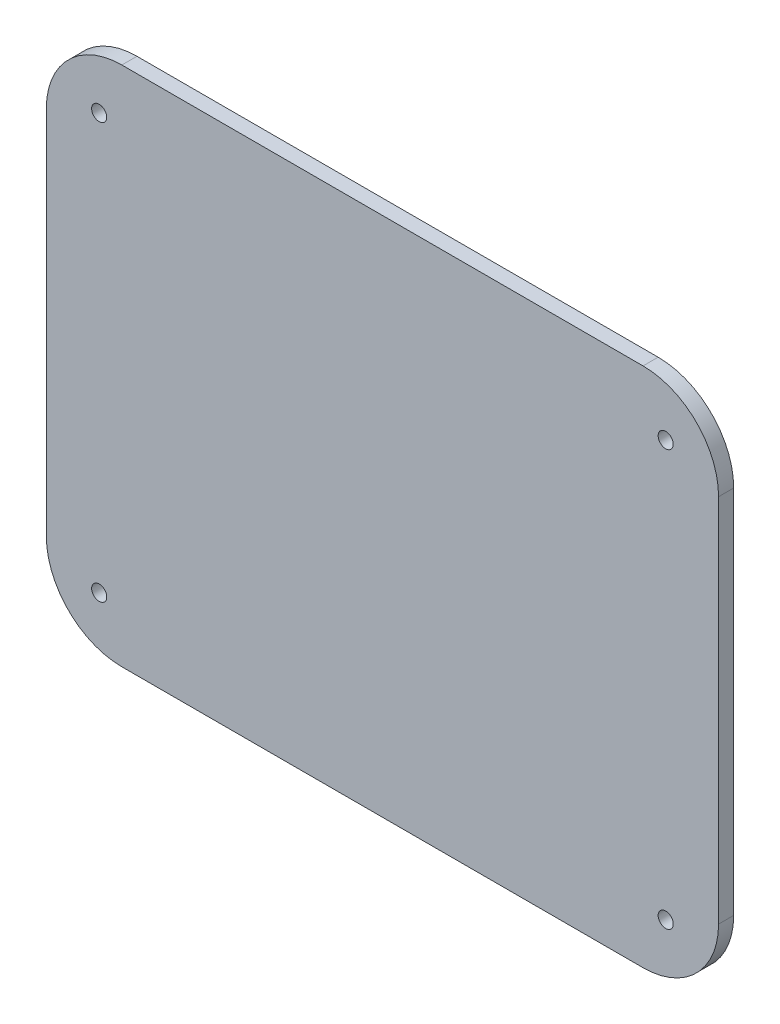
from build123d import *

# Parameters (mm, degrees)
SKETCH_1_R      = 1
EXTRUDE_1_DEPTH = 2


with BuildPart() as part:
    # Sketch 1 → Extrude 1 (new body)
    # profile 1 of 8: a face of its own
    with BuildSketch(Plane.XY):
        Polygon((44.5, 0), (10, 0), (10, -10), (0, -10), (0, -34.5), (44.5, -34.5), align=None)
    # profile 2 of 8: a face of its own
    with BuildSketch(Plane.XY):
        Polygon((79, 0), (44.5, 0), (44.5, -34.5), (89, -34.5), (89, -10), (79, -10), align=None)
    # profile 3 of 8: a face of its own
    with BuildSketch(Plane.XY):
        Polygon((44.5, -69), (44.5, -34.5), (0, -34.5), (0, -59), (10, -59), (10, -69), align=None)
    # profile 4 of 8: a face of its own
    with BuildSketch(Plane.XY):
        Polygon((89, -34.5), (44.5, -34.5), (44.5, -69), (79, -69), (79, -59), (89, -59), align=None)
    # profile 5 of 8: a face of its own
    with BuildSketch(Plane.XY):
        with BuildLine():
            Line((10, 0), (10, -10))
            Line((10, -10), (0, -10))
            ThreePointArc((0, -10), (2.928932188, -2.928932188), (10, 0))
        make_face()
        with Locations((7, -7)):
            Circle(SKETCH_1_R, mode=Mode.SUBTRACT)
    # profile 6 of 8: a face of its own
    with BuildSketch(Plane.XY):
        with BuildLine():
            ThreePointArc((79, 0), (86.071067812, -2.928932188), (89, -10))
            Line((89, -10), (79, -10))
            Line((79, -10), (79, 0))
        make_face()
        with Locations((82, -7)):
            Circle(SKETCH_1_R, mode=Mode.SUBTRACT)
    # profile 7 of 8: a face of its own
    with BuildSketch(Plane.XY):
        with BuildLine():
            Line((10, -59), (0, -59))
            ThreePointArc((0, -59), (2.928932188, -66.071067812), (10, -69))
            Line((10, -69), (10, -59))
        make_face()
        with Locations((7, -62)):
            Circle(SKETCH_1_R, mode=Mode.SUBTRACT)
    # profile 8 of 8: a face of its own
    with BuildSketch(Plane.XY):
        with BuildLine():
            Line((79, -69), (79, -59))
            Line((79, -59), (89, -59))
            ThreePointArc((89, -59), (86.071067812, -66.071067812), (79, -69))
        make_face()
        with Locations((82, -62)):
            Circle(SKETCH_1_R, mode=Mode.SUBTRACT)
    extrude(amount=-EXTRUDE_1_DEPTH)


solid = part.part
